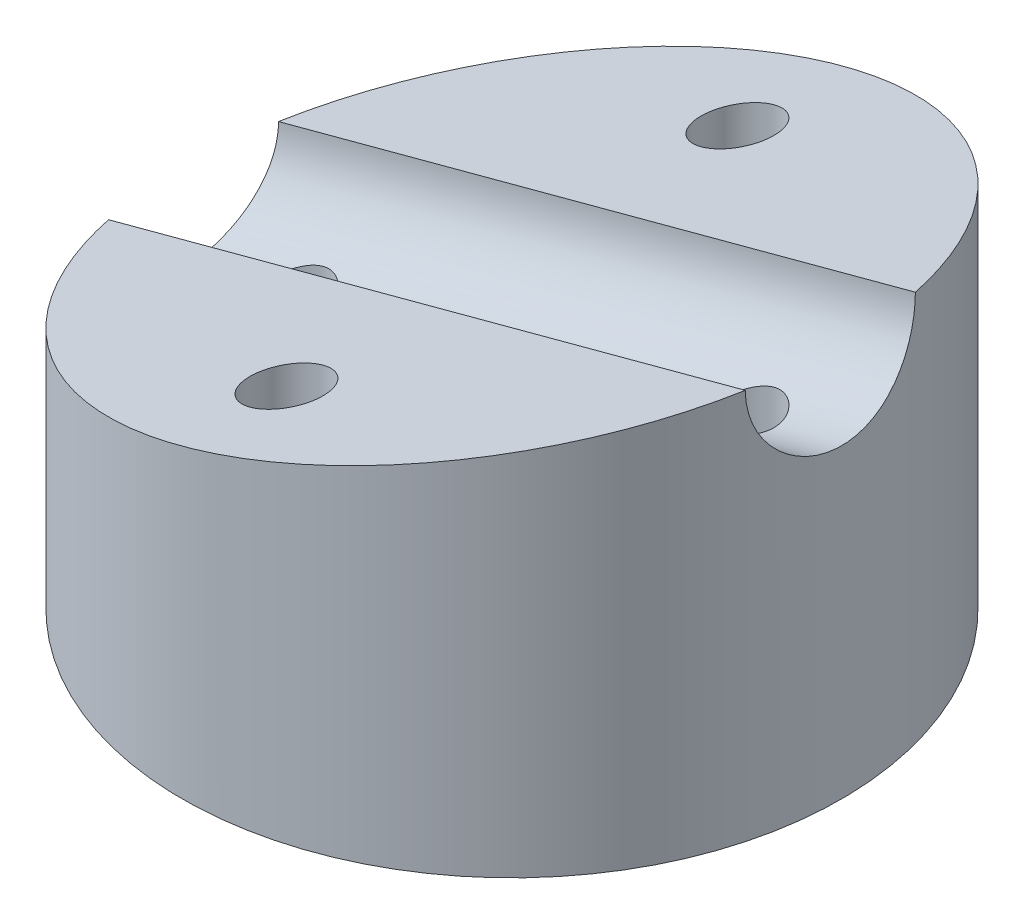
from build123d import *

# Parameters (mm, degrees)
TROU_TARAUD_M5X0_81_D                     = 4.2
TROU_TARAUD_M5X0_81_DEPTH                 = 12.4
TROU_TARAUD_M5X0_81_CSINK_D               = 5
TROU_TARAUD_M5X0_81_CSINK_ANGLE           = 90
TROU_TARAUD_M5X0_81_TIP                   = 1.212435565
ENL_V_START                               = -0.5
ESQUISSE8_R                               = 19
ESQUISSE8_R_2                             = 7.5
ENL_V_MAT_EXTRU_1_DEPTH                   = 0.5
ENL_V_MAT_EXTRU_8_DEPTH                   = 25
TROU_TARAUD_M5X0_82_D                     = 4.2
TROU_TARAUD_M5X0_82_CSINK_D               = 5
TROU_TARAUD_M5X0_82_CSINK_ANGLE           = 90
TROU_POUR_TARAUDAGE_POUR_TROU_TARAUD_M5_D = 4.2
TROU_POUR_TARAUDAGE_POUR_TROU_TARAUD_2_D  = 4.2
CONG_1_R                                  = 0.2
CHANFREIN1_SIZE                           = 0.3


with BuildPart() as part:
    # Esquisse1 → R_volution1 (revolve)
    with BuildSketch(Plane.XY):
        Polygon((6, 0), (19, 0), (19, 30), (0, 30), (0, -36), (4, -36), (4, -29), (5, -29), (5, -10), (6, -10), align=None)
    revolve(axis=Axis((0, -36, 0), (0, 1, 0)))

    # Esquisse5 → Enl_vement de mati_re-R_volution1 (revolve, cut)
    with BuildSketch(Plane.XY, mode=Mode.PRIVATE) as enl_vement_de_mati_re_r_volution1_sk:
        Polygon((53.426216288, 32.432844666), (52.158002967, 37.165881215), (-34.775321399, 13.872167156), (-33.507108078, 9.139130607), align=None)
    revolve(enl_vement_de_mati_re_r_volution1_sk.sketch.rotate(Axis((-44.487037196, 6.197067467, 0), (0.9659258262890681, 0.25881904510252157, 0)), 180), axis=Axis((-44.487037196, 6.197067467, 0), (0.9659258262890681, 0.25881904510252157, 0)), mode=Mode.SUBTRACT)

    # Trou taraud_ M5x0.81
    with Locations(Plane.XZ.offset(36)):
        with Locations((0, 0)):
            CounterSinkHole(TROU_TARAUD_M5X0_81_D / 2, TROU_TARAUD_M5X0_81_CSINK_D / 2, depth=TROU_TARAUD_M5X0_81_DEPTH, counter_sink_angle=TROU_TARAUD_M5X0_81_CSINK_ANGLE)
            with Locations((0, 0, -(TROU_TARAUD_M5X0_81_DEPTH + TROU_TARAUD_M5X0_81_TIP / 2))):  # 120° drill point
                Cone(0, TROU_TARAUD_M5X0_81_D / 2, TROU_TARAUD_M5X0_81_TIP, mode=Mode.SUBTRACT)

    # Esquisse8 → Enl_v. mat.-Extru.1 (cut)
    with BuildSketch(Plane.XZ.offset(ENL_V_START)):
        Circle(ESQUISSE8_R)
        with Locations(Location((0, 0, 0), (0, 0, 270))):
            Circle(ESQUISSE8_R_2, mode=Mode.SUBTRACT)
    extrude(amount=ENL_V_MAT_EXTRU_1_DEPTH, mode=Mode.SUBTRACT)

    # Esquisse18 → Enl_v. mat.-Extru.8 (cut, symmetric)
    with BuildSketch(Plane.XY):
        Polygon((-19, 13.026298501), (19, 23.208367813), (19, 30), (-19, 30), align=None)
    extrude(amount=ENL_V_MAT_EXTRU_8_DEPTH, both=True, mode=Mode.SUBTRACT)

    # Trou taraud_ M5x0.82 (through all)
    with Locations(Plane.XZ):
        with Locations((0, 13), (0, -13)):
            CounterSinkHole(TROU_TARAUD_M5X0_82_D / 2, TROU_TARAUD_M5X0_82_CSINK_D / 2, counter_sink_angle=TROU_TARAUD_M5X0_82_CSINK_ANGLE)

    # Esquisse22 → Enl_vement de mati_re-R_volution2 (revolve, cut)
    with BuildSketch(Plane.XY, mode=Mode.PRIVATE) as enl_vement_de_mati_re_r_volution2_sk:
        Polygon((0, 3.5), (15.5, 3.5), (18.5, 3.5), (18.5, 0.5), (18.5, -36), (0, -36), align=None)
    revolve(enl_vement_de_mati_re_r_volution2_sk.sketch.rotate(Axis((0, 18.435875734, 0), (0, -1, 0)), 14.945150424), axis=Axis((0, 18.435875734, 0), (0, -1, 0)), mode=Mode.SUBTRACT)

    # Trou pour taraudage pour trou taraud_ M5 (through all)
    with Locations(Plane(origin=(13, 3.5, 0), x_dir=(-1, 0, 0), z_dir=(0, -1, 0))):
        with Locations((0, 0)):
            Hole(TROU_POUR_TARAUDAGE_POUR_TROU_TARAUD_M5_D / 2)

    # Trou pour taraudage pour trou taraud 2 (through all)
    with Locations(Plane(origin=(-13, 3.5, 0), x_dir=(-1, 0, 0), z_dir=(0, -1, 0))):
        with Locations((0, 0)):
            Hole(TROU_POUR_TARAUDAGE_POUR_TROU_TARAUD_2_D / 2)

    # Cong_1
    cong_1_edges = [part.edges().sort_by_distance(p)[0] for p in [
        (-17.874203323, 3.5, -4.771043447),
    ]]
    fillet(cong_1_edges, radius=CONG_1_R)

    # Chanfrein1
    chanfrein1_edges = [part.edges().sort_by_distance(p)[0] for p in [
        (2.1, 3.5, -13),
        (2.1, 3.5, 13),
        (10.9, 3.5, 0),
        (-15.1, 3.5, 0),
    ]]
    chamfer(chanfrein1_edges, length=CHANFREIN1_SIZE)


solid = part.part
